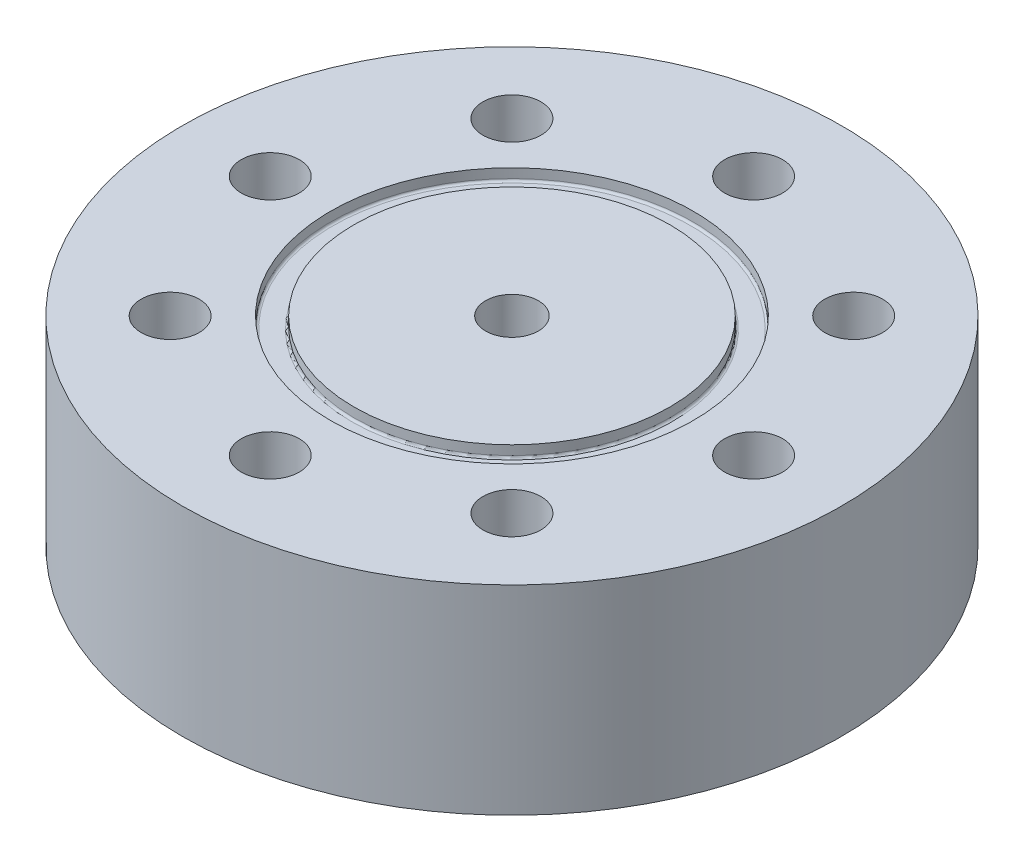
from build123d import *

# Parameters (mm, degrees)
SKETCH2_R                 = 37.5
OUTER_CYLINDER_DEPTH      = 22.7
SKETCH3_R                 = 8.93
NPT_HOLE_DEPTH            = 12.7
SKETCH4_R                 = 3.3
BOLT_HOLES_DEPTH          = 58.687000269
SKETCH5_R                 = 20.6375
SKETCH5_R_2               = 17.9705
O_RING_GROOVE_DEPTH       = 1.3208
FILLET1_R                 = 0.254
SKETCH6_R                 = 3
INLET_FLOW_DIAMETER_DEPTH = 10


with BuildPart() as part:
    # Sketch2 → Outer Cylinder (new body)
    with BuildSketch(Plane(origin=(0, 0, 0), x_dir=(1, 0, 0), z_dir=(0, 1, 0))):
        with Locations(Location((0, 0, 0), (0, 0, 270))):
            Circle(SKETCH2_R)
    extrude(amount=OUTER_CYLINDER_DEPTH)

    # Sketch3 → NPT Hole (cut)
    with BuildSketch(Plane.XZ):
        with Locations(Location((0, 0, 0), (0, 0, 270))):
            Circle(SKETCH3_R)
    extrude(amount=-NPT_HOLE_DEPTH, mode=Mode.SUBTRACT)

    # Sketch4 → Bolt Holes (cut, through all)
    with BuildSketch(Plane.XZ):
        with Locations(Location((-27.5, 0, 0), (0, 0, 270))):
            Circle(SKETCH4_R)
        with Locations(Location((-19.445436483, 19.445436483, 0), (0, 0, 270))):
            Circle(SKETCH4_R)
        with Locations(Location((0, 27.5, 0), (0, 0, 270))):
            Circle(SKETCH4_R)
        with Locations(Location((19.445436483, 19.445436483, 0), (0, 0, 270))):
            Circle(SKETCH4_R)
        with Locations(Location((27.5, 0, 0), (0, 0, 270))):
            Circle(SKETCH4_R)
        with Locations(Location((19.445436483, -19.445436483, 0), (0, 0, 270))):
            Circle(SKETCH4_R)
        with Locations(Location((0, -27.5, 0), (0, 0, 270))):
            Circle(SKETCH4_R)
        with Locations(Location((-19.445436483, -19.445436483, 0), (0, 0, 270))):
            Circle(SKETCH4_R)
    extrude(amount=-BOLT_HOLES_DEPTH, mode=Mode.SUBTRACT)

    # Sketch5 → O-Ring Groove (cut)
    with BuildSketch(Plane(origin=(0, 22.7, 0), x_dir=(1, 0, 0), z_dir=(0, 1, 0))):
        with Locations(Location((0, 0, 0), (0, 0, 270))):
            Circle(SKETCH5_R)
        with Locations(Location((0, 0, 0), (0, 0, 270))):
            Circle(SKETCH5_R_2, mode=Mode.SUBTRACT)
    extrude(amount=-O_RING_GROOVE_DEPTH, mode=Mode.SUBTRACT)

    # Fillet1
    fillet1_edges = [part.edges().sort_by_distance(p)[0] for p in [
        (0, 21.3792, -20.6375),
        (0, 21.3792, -17.9705),
    ]]
    fillet(fillet1_edges, radius=FILLET1_R)

    # Sketch6 → Inlet Flow Diameter (cut)
    with BuildSketch(Plane(origin=(0, 22.7, 0), x_dir=(1, 0, 0), z_dir=(0, 1, 0))):
        with Locations(Location((0, 0, 0), (0, 0, 270))):
            Circle(SKETCH6_R)
    extrude(amount=-INLET_FLOW_DIAMETER_DEPTH, mode=Mode.SUBTRACT)


solid = part.part
